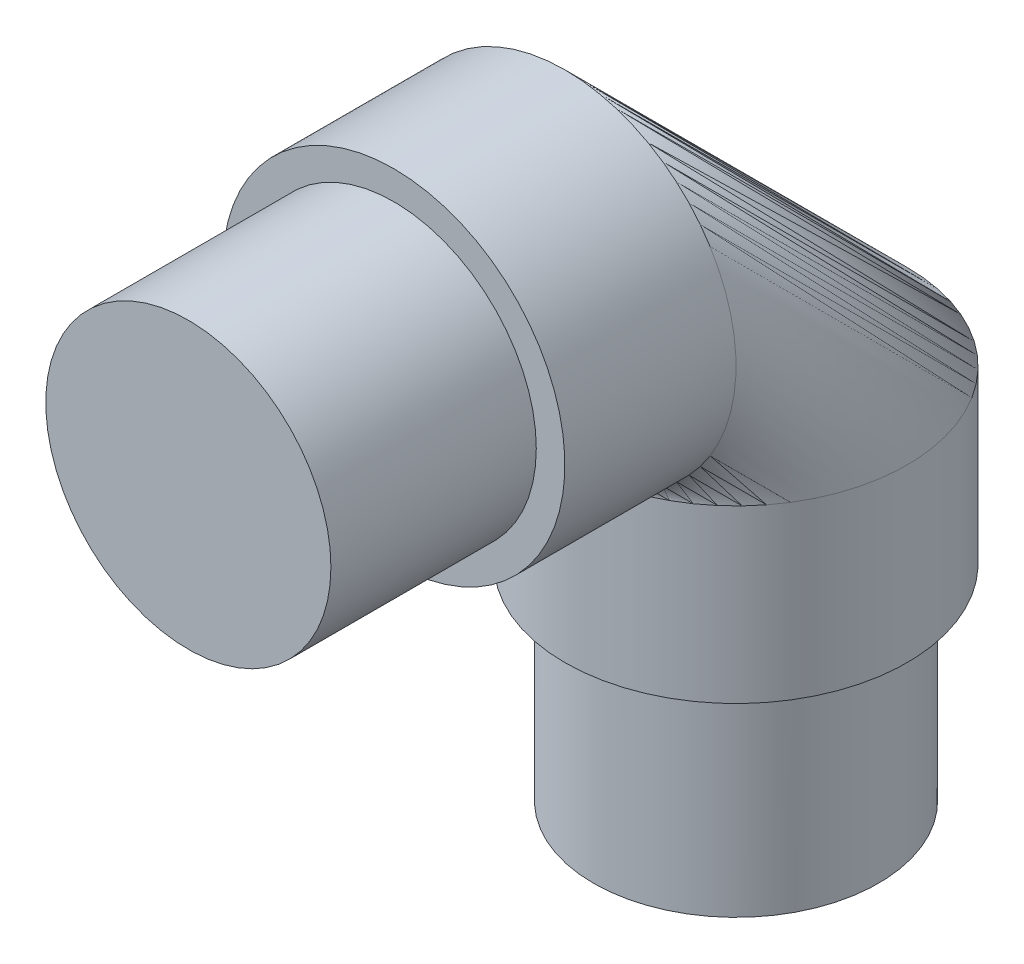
ISO-10303-21;
HEADER;
FILE_DESCRIPTION(('STEP AP214'),'2;1');
FILE_NAME('part.step','',(''),(''),'','','');
FILE_SCHEMA(('AUTOMOTIVE_DESIGN { 1 0 10303 214 1 1 1 1 }'));
ENDSEC;
DATA;
#1=APPLICATION_CONTEXT('core data for automotive mechanical design processes');
#2=APPLICATION_PROTOCOL_DEFINITION('international standard','automotive_design',2000,#1);
#3=PRODUCT_CONTEXT('',#1,'mechanical');
#4=PRODUCT('Part','Part','',(#3));
#5=PRODUCT_RELATED_PRODUCT_CATEGORY('part','',(#4));
#6=PRODUCT_DEFINITION_FORMATION('','',#4);
#7=PRODUCT_DEFINITION_CONTEXT('part definition',#1,'design');
#8=PRODUCT_DEFINITION('design','',#6,#7);
#9=PRODUCT_DEFINITION_SHAPE('','',#8);
#10=(LENGTH_UNIT() NAMED_UNIT(*) SI_UNIT(.MILLI.,.METRE.));
#11=(NAMED_UNIT(*) PLANE_ANGLE_UNIT() SI_UNIT($,.RADIAN.));
#12=(NAMED_UNIT(*) SI_UNIT($,.STERADIAN.) SOLID_ANGLE_UNIT());
#13=UNCERTAINTY_MEASURE_WITH_UNIT(LENGTH_MEASURE(1.E-05),#10,'distance_accuracy_value','');
#14=(GEOMETRIC_REPRESENTATION_CONTEXT(3) GLOBAL_UNCERTAINTY_ASSIGNED_CONTEXT((#13)) GLOBAL_UNIT_ASSIGNED_CONTEXT((#10,
#11,#12)) REPRESENTATION_CONTEXT('',''));
#15=CARTESIAN_POINT('',(0.,0.,0.));
#16=DIRECTION('',(0.,0.,1.));
#17=DIRECTION('',(1.,0.,0.));
#18=AXIS2_PLACEMENT_3D('',#15,#16,#17);
#19=CARTESIAN_POINT('',(0.,0.,12.));
#20=DIRECTION('',(0.,0.,-1.));
#21=DIRECTION('',(-1.,0.,0.));
#22=AXIS2_PLACEMENT_3D('',#19,#20,#21);
#23=CYLINDRICAL_SURFACE('',#22,8.33);
#24=CARTESIAN_POINT('',(0.,0.,12.));
#25=DIRECTION('',(0.,0.,1.));
#26=DIRECTION('',(1.,0.,0.));
#27=AXIS2_PLACEMENT_3D('',#24,#25,#26);
#28=CIRCLE('',#27,8.33);
#29=CARTESIAN_POINT('',(8.33,0.,12.));
#30=VERTEX_POINT('',#29);
#31=EDGE_CURVE('E54',#30,#30,#28,.T.);
#32=ORIENTED_EDGE('',*,*,#31,.F.);
#33=EDGE_LOOP('',(#32));
#34=FACE_BOUND('',#33,.T.);
#35=CARTESIAN_POINT('',(0.,0.,0.));
#36=DIRECTION('',(0.,0.,1.));
#37=DIRECTION('',(1.,0.,0.));
#38=AXIS2_PLACEMENT_3D('',#35,#36,#37);
#39=CIRCLE('',#38,8.33);
#40=CARTESIAN_POINT('',(8.33,0.,0.));
#41=VERTEX_POINT('',#40);
#42=EDGE_CURVE('E82',#41,#41,#39,.T.);
#43=ORIENTED_EDGE('',*,*,#42,.T.);
#44=EDGE_LOOP('',(#43));
#45=FACE_BOUND('',#44,.T.);
#46=ADVANCED_FACE('F47',(#34,#45),#23,.T.);
#47=CARTESIAN_POINT('',(0.,0.,12.));
#48=DIRECTION('',(0.,0.,1.));
#49=DIRECTION('',(1.,0.,0.));
#50=AXIS2_PLACEMENT_3D('',#47,#48,#49);
#51=PLANE('',#50);
#52=ORIENTED_EDGE('',*,*,#31,.T.);
#53=EDGE_LOOP('',(#52));
#54=FACE_BOUND('',#53,.T.);
#55=ADVANCED_FACE('F87',(#54),#51,.T.);
#56=CARTESIAN_POINT('',(0.,0.,0.));
#57=DIRECTION('',(0.,0.,1.));
#58=DIRECTION('',(0.,-1.,0.));
#59=AXIS2_PLACEMENT_3D('',#56,#57,#58);
#60=PLANE('',#59);
#61=ORIENTED_EDGE('',*,*,#42,.F.);
#62=EDGE_LOOP('',(#61));
#63=FACE_BOUND('',#62,.T.);
#64=CARTESIAN_POINT('',(0.,0.,0.));
#65=DIRECTION('',(0.,0.,1.));
#66=DIRECTION('',(0.,-1.,0.));
#67=AXIS2_PLACEMENT_3D('',#64,#65,#66);
#68=CIRCLE('',#67,10.);
#69=CARTESIAN_POINT('',(0.,-10.,0.));
#70=VERTEX_POINT('',#69);
#71=EDGE_CURVE('E59',#70,#70,#68,.T.);
#72=ORIENTED_EDGE('',*,*,#71,.T.);
#73=EDGE_LOOP('',(#72));
#74=FACE_BOUND('',#73,.T.);
#75=ADVANCED_FACE('F93',(#63,#74),#60,.T.);
#76=CARTESIAN_POINT('',(0.,-20.,-20.));
#77=DIRECTION('',(0.,1.,0.));
#78=DIRECTION('',(0.,0.,1.));
#79=AXIS2_PLACEMENT_3D('',#76,#77,#78);
#80=PLANE('',#79);
#81=CARTESIAN_POINT('',(0.,-20.,-20.));
#82=DIRECTION('',(0.,1.,0.));
#83=DIRECTION('',(0.,0.,1.));
#84=AXIS2_PLACEMENT_3D('',#81,#82,#83);
#85=CIRCLE('',#84,8.33);
#86=CARTESIAN_POINT('',(0.,-20.,-11.67));
#87=VERTEX_POINT('',#86);
#88=EDGE_CURVE('E12',#87,#87,#85,.F.);
#89=ORIENTED_EDGE('',*,*,#88,.F.);
#90=EDGE_LOOP('',(#89));
#91=FACE_BOUND('',#90,.T.);
#92=CARTESIAN_POINT('',(0.,-20.,-20.));
#93=DIRECTION('',(0.,1.,0.));
#94=DIRECTION('',(0.,0.,1.));
#95=AXIS2_PLACEMENT_3D('',#92,#93,#94);
#96=CIRCLE('',#95,10.);
#97=CARTESIAN_POINT('',(0.,-20.,-10.));
#98=VERTEX_POINT('',#97);
#99=EDGE_CURVE('E64',#98,#98,#96,.T.);
#100=ORIENTED_EDGE('',*,*,#99,.F.);
#101=EDGE_LOOP('',(#100));
#102=FACE_BOUND('',#101,.T.);
#103=ADVANCED_FACE('F96',(#91,#102),#80,.F.);
#104=CARTESIAN_POINT('',(0.,0.,0.));
#105=DIRECTION('',(0.,0.,-1.));
#106=DIRECTION('',(-1.,0.,0.));
#107=AXIS2_PLACEMENT_3D('',#104,#105,#106);
#108=CYLINDRICAL_SURFACE('',#107,10.);
#109=CARTESIAN_POINT('',(0.,0.,-9.99999999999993));
#110=DIRECTION('',(0.,0.,1.));
#111=DIRECTION('',(0.,-1.,0.));
#112=AXIS2_PLACEMENT_3D('',#109,#110,#111);
#113=CIRCLE('',#112,10.);
#114=CARTESIAN_POINT('',(0.,-10.,-10.));
#115=VERTEX_POINT('',#114);
#116=EDGE_CURVE('E70',#115,#115,#113,.T.);
#117=ORIENTED_EDGE('',*,*,#116,.T.);
#118=EDGE_LOOP('',(#117));
#119=FACE_BOUND('',#118,.T.);
#120=ORIENTED_EDGE('',*,*,#71,.F.);
#121=EDGE_LOOP('',(#120));
#122=FACE_BOUND('',#121,.T.);
#123=ADVANCED_FACE('F103',(#119,#122),#108,.T.);
#124=CARTESIAN_POINT('',(0.,-10.,-10.));
#125=DIRECTION('',(-1.,0.,0.));
#126=DIRECTION('',(0.,0.,1.));
#127=AXIS2_PLACEMENT_3D('',#124,#125,#126);
#128=DEGENERATE_TOROIDAL_SURFACE('',#127,10.,10.,.T.);
#129=CARTESIAN_POINT('',(0.,-9.99999999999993,-20.0000000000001));
#130=DIRECTION('',(0.,1.,0.));
#131=DIRECTION('',(0.,0.,1.));
#132=AXIS2_PLACEMENT_3D('',#129,#130,#131);
#133=CIRCLE('',#132,10.);
#134=EDGE_CURVE('E73',#115,#115,#133,.T.);
#135=ORIENTED_EDGE('',*,*,#134,.T.);
#136=ORIENTED_EDGE('',*,*,#116,.F.);
#137=EDGE_LOOP('',(#135,#136));
#138=FACE_BOUND('',#137,.T.);
#139=ADVANCED_FACE('F71',(#138),#128,.T.);
#140=CARTESIAN_POINT('',(0.,-10.0000000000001,-20.));
#141=DIRECTION('',(0.,-1.,0.));
#142=DIRECTION('',(0.,0.,-1.));
#143=AXIS2_PLACEMENT_3D('',#140,#141,#142);
#144=CYLINDRICAL_SURFACE('',#143,10.);
#145=ORIENTED_EDGE('',*,*,#99,.T.);
#146=EDGE_LOOP('',(#145));
#147=FACE_BOUND('',#146,.T.);
#148=ORIENTED_EDGE('',*,*,#134,.F.);
#149=EDGE_LOOP('',(#148));
#150=FACE_BOUND('',#149,.T.);
#151=ADVANCED_FACE('F106',(#147,#150),#144,.T.);
#152=CARTESIAN_POINT('',(0.,-32.,-20.));
#153=DIRECTION('',(0.,1.,0.));
#154=DIRECTION('',(0.,0.,1.));
#155=AXIS2_PLACEMENT_3D('',#152,#153,#154);
#156=CYLINDRICAL_SURFACE('',#155,8.33);
#157=CARTESIAN_POINT('',(0.,-32.,-20.));
#158=DIRECTION('',(0.,-1.,0.));
#159=DIRECTION('',(0.,0.,-1.));
#160=AXIS2_PLACEMENT_3D('',#157,#158,#159);
#161=CIRCLE('',#160,8.33);
#162=CARTESIAN_POINT('',(0.,-32.,-28.33));
#163=VERTEX_POINT('',#162);
#164=EDGE_CURVE('E77',#163,#163,#161,.T.);
#165=ORIENTED_EDGE('',*,*,#164,.F.);
#166=EDGE_LOOP('',(#165));
#167=FACE_BOUND('',#166,.T.);
#168=ORIENTED_EDGE('',*,*,#88,.T.);
#169=EDGE_LOOP('',(#168));
#170=FACE_BOUND('',#169,.T.);
#171=ADVANCED_FACE('F98',(#167,#170),#156,.T.);
#172=CARTESIAN_POINT('',(0.,-32.,-20.));
#173=DIRECTION('',(0.,-1.,0.));
#174=DIRECTION('',(0.,0.,-1.));
#175=AXIS2_PLACEMENT_3D('',#172,#173,#174);
#176=PLANE('',#175);
#177=ORIENTED_EDGE('',*,*,#164,.T.);
#178=EDGE_LOOP('',(#177));
#179=FACE_BOUND('',#178,.T.);
#180=ADVANCED_FACE('F108',(#179),#176,.T.);
#181=CLOSED_SHELL('',(#46,#55,#75,#103,#123,#139,#151,#171,#180));
#182=MANIFOLD_SOLID_BREP('B2',#181);
#183=ADVANCED_BREP_SHAPE_REPRESENTATION('',(#18,#182),#14);
#184=SHAPE_DEFINITION_REPRESENTATION(#9,#183);
ENDSEC;
END-ISO-10303-21;
